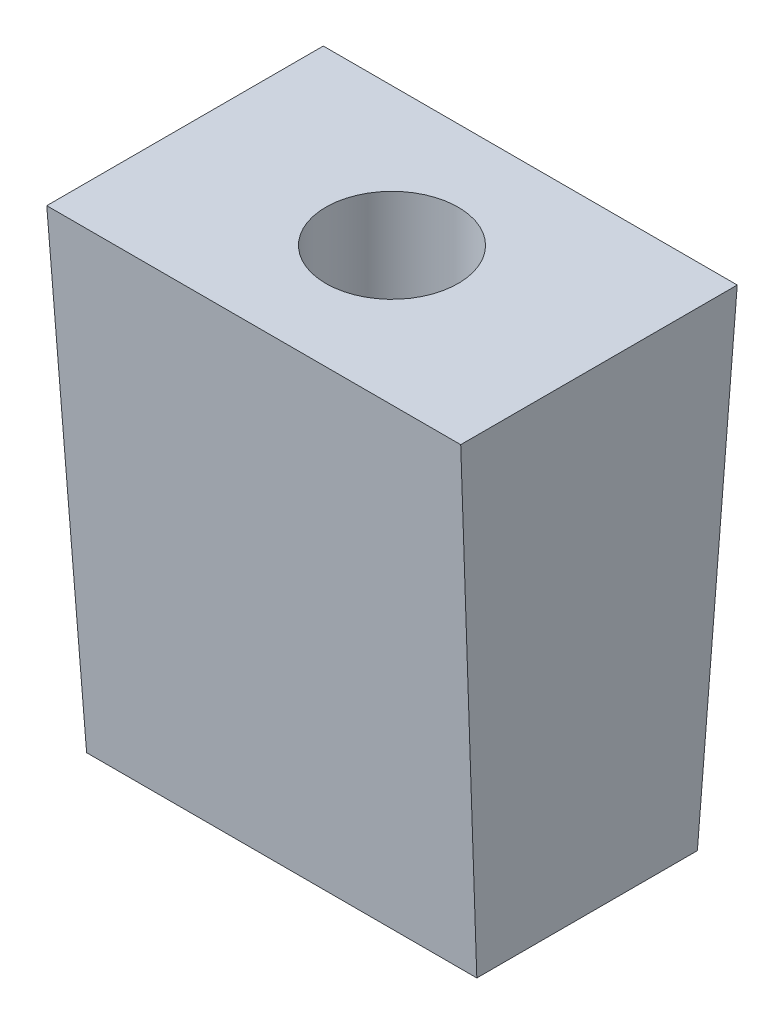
ISO-10303-21;
HEADER;
FILE_DESCRIPTION(('STEP AP214'),'2;1');
FILE_NAME('part.step','',(''),(''),'','','');
FILE_SCHEMA(('AUTOMOTIVE_DESIGN { 1 0 10303 214 1 1 1 1 }'));
ENDSEC;
DATA;
#1=APPLICATION_CONTEXT('core data for automotive mechanical design processes');
#2=APPLICATION_PROTOCOL_DEFINITION('international standard','automotive_design',2000,#1);
#3=PRODUCT_CONTEXT('',#1,'mechanical');
#4=PRODUCT('Part','Part','',(#3));
#5=PRODUCT_RELATED_PRODUCT_CATEGORY('part','',(#4));
#6=PRODUCT_DEFINITION_FORMATION('','',#4);
#7=PRODUCT_DEFINITION_CONTEXT('part definition',#1,'design');
#8=PRODUCT_DEFINITION('design','',#6,#7);
#9=PRODUCT_DEFINITION_SHAPE('','',#8);
#10=(LENGTH_UNIT() NAMED_UNIT(*) SI_UNIT(.MILLI.,.METRE.));
#11=(NAMED_UNIT(*) PLANE_ANGLE_UNIT() SI_UNIT($,.RADIAN.));
#12=(NAMED_UNIT(*) SI_UNIT($,.STERADIAN.) SOLID_ANGLE_UNIT());
#13=UNCERTAINTY_MEASURE_WITH_UNIT(LENGTH_MEASURE(1.E-05),#10,'distance_accuracy_value','');
#14=(GEOMETRIC_REPRESENTATION_CONTEXT(3) GLOBAL_UNCERTAINTY_ASSIGNED_CONTEXT((#13)) GLOBAL_UNIT_ASSIGNED_CONTEXT((#10,
#11,#12)) REPRESENTATION_CONTEXT('',''));
#15=CARTESIAN_POINT('',(0.,0.,0.));
#16=DIRECTION('',(0.,0.,1.));
#17=DIRECTION('',(1.,0.,0.));
#18=AXIS2_PLACEMENT_3D('',#15,#16,#17);
#19=CARTESIAN_POINT('',(0.,17.35,-4.075));
#20=DIRECTION('',(0.,-1.,0.));
#21=DIRECTION('',(0.,0.,-1.));
#22=AXIS2_PLACEMENT_3D('',#19,#20,#21);
#23=CYLINDRICAL_SURFACE('',#22,1.25);
#24=CARTESIAN_POINT('',(0.,9.2,-4.075));
#25=DIRECTION('',(0.,-1.,0.));
#26=DIRECTION('',(0.,0.,-1.));
#27=AXIS2_PLACEMENT_3D('',#24,#25,#26);
#28=CIRCLE('',#27,1.25);
#29=CARTESIAN_POINT('',(0.,9.2,-5.325));
#30=VERTEX_POINT('',#29);
#31=EDGE_CURVE('E116',#30,#30,#28,.T.);
#32=ORIENTED_EDGE('',*,*,#31,.T.);
#33=EDGE_LOOP('',(#32));
#34=FACE_BOUND('',#33,.T.);
#35=CARTESIAN_POINT('',(0.,11.3,-4.075));
#36=DIRECTION('',(0.,1.,0.));
#37=DIRECTION('',(0.,0.,1.));
#38=AXIS2_PLACEMENT_3D('',#35,#36,#37);
#39=CIRCLE('',#38,1.25);
#40=CARTESIAN_POINT('',(0.,11.3,-2.825));
#41=VERTEX_POINT('',#40);
#42=EDGE_CURVE('E37',#41,#41,#39,.F.);
#43=ORIENTED_EDGE('',*,*,#42,.F.);
#44=EDGE_LOOP('',(#43));
#45=FACE_BOUND('',#44,.T.);
#46=ADVANCED_FACE('F33',(#34,#45),#23,.F.);
#47=CARTESIAN_POINT('',(33.1477380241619,14.2,0.));
#48=DIRECTION('',(0.,0.0580007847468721,-0.998316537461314));
#49=DIRECTION('',(0.,0.998316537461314,0.0580007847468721));
#50=AXIS2_PLACEMENT_3D('',#47,#48,#49);
#51=PLANE('',#50);
#52=DIRECTION('',(-1.,0.,0.));
#53=VECTOR('',#52,1.);
#54=CARTESIAN_POINT('',(-6.1,14.2,0.));
#55=LINE('',#54,#53);
#56=CARTESIAN_POINT('',(6.1,14.2,0.));
#57=VERTEX_POINT('',#56);
#58=CARTESIAN_POINT('',(-6.1,14.2,0.));
#59=VERTEX_POINT('',#58);
#60=EDGE_CURVE('E82',#57,#59,#55,.T.);
#61=ORIENTED_EDGE('',*,*,#60,.T.);
#62=DIRECTION('',(0.0245989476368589,-0.998014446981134,-0.0579832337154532));
#63=VECTOR('',#62,1.);
#64=CARTESIAN_POINT('',(-5.73955215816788,-0.423883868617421,-0.849627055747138));
#65=LINE('',#64,#63);
#66=CARTESIAN_POINT('',(-5.75,0.,-0.825));
#67=VERTEX_POINT('',#66);
#68=EDGE_CURVE('E86',#59,#67,#65,.T.);
#69=ORIENTED_EDGE('',*,*,#68,.T.);
#70=DIRECTION('',(-1.,0.,0.));
#71=VECTOR('',#70,1.);
#72=CARTESIAN_POINT('',(33.1477380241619,0.,-0.825));
#73=LINE('',#72,#71);
#74=CARTESIAN_POINT('',(5.75,0.,-0.825));
#75=VERTEX_POINT('',#74);
#76=EDGE_CURVE('E106',#75,#67,#73,.T.);
#77=ORIENTED_EDGE('',*,*,#76,.F.);
#78=DIRECTION('',(0.0245989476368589,0.998014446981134,0.0579832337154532));
#79=VECTOR('',#78,1.);
#80=CARTESIAN_POINT('',(5.73955215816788,-0.423883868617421,-0.849627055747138));
#81=LINE('',#80,#79);
#82=EDGE_CURVE('E90',#75,#57,#81,.T.);
#83=ORIENTED_EDGE('',*,*,#82,.T.);
#84=EDGE_LOOP('',(#61,#69,#77,#83));
#85=FACE_BOUND('',#84,.T.);
#86=ADVANCED_FACE('F92',(#85),#51,.F.);
#87=CARTESIAN_POINT('',(-5.75,0.,-8.15));
#88=DIRECTION('',(0.,-1.,0.));
#89=DIRECTION('',(0.,0.,-1.));
#90=AXIS2_PLACEMENT_3D('',#87,#88,#89);
#91=PLANE('',#90);
#92=CARTESIAN_POINT('',(0.,0.,-4.075));
#93=DIRECTION('',(0.,-1.,0.));
#94=DIRECTION('',(0.,0.,-1.));
#95=AXIS2_PLACEMENT_3D('',#92,#93,#94);
#96=CIRCLE('',#95,2.45);
#97=CARTESIAN_POINT('',(0.,0.,-6.525));
#98=VERTEX_POINT('',#97);
#99=EDGE_CURVE('E113',#98,#98,#96,.T.);
#100=ORIENTED_EDGE('',*,*,#99,.F.);
#101=EDGE_LOOP('',(#100));
#102=FACE_BOUND('',#101,.T.);
#103=DIRECTION('',(0.,0.,1.));
#104=VECTOR('',#103,1.);
#105=CARTESIAN_POINT('',(5.75,0.,-8.15));
#106=LINE('',#105,#104);
#107=CARTESIAN_POINT('',(5.75,0.,-7.325));
#108=VERTEX_POINT('',#107);
#109=EDGE_CURVE('E50',#108,#75,#106,.T.);
#110=ORIENTED_EDGE('',*,*,#109,.T.);
#111=ORIENTED_EDGE('',*,*,#76,.T.);
#112=DIRECTION('',(0.,0.,1.));
#113=VECTOR('',#112,1.);
#114=CARTESIAN_POINT('',(-5.75,0.,-8.15));
#115=LINE('',#114,#113);
#116=CARTESIAN_POINT('',(-5.75,0.,-7.325));
#117=VERTEX_POINT('',#116);
#118=EDGE_CURVE('E58',#117,#67,#115,.T.);
#119=ORIENTED_EDGE('',*,*,#118,.F.);
#120=DIRECTION('',(-1.,0.,0.));
#121=VECTOR('',#120,1.);
#122=CARTESIAN_POINT('',(33.1477380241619,0.,-7.325));
#123=LINE('',#122,#121);
#124=EDGE_CURVE('E108',#108,#117,#123,.T.);
#125=ORIENTED_EDGE('',*,*,#124,.F.);
#126=EDGE_LOOP('',(#110,#111,#119,#125));
#127=FACE_BOUND('',#126,.T.);
#128=ADVANCED_FACE('F136',(#102,#127),#91,.T.);
#129=CARTESIAN_POINT('',(-5.75,0.,-8.15));
#130=DIRECTION('',(-0.999696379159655,-0.0246404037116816,0.));
#131=DIRECTION('',(0.0246404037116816,-0.999696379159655,0.));
#132=AXIS2_PLACEMENT_3D('',#129,#130,#131);
#133=PLANE('',#132);
#134=ORIENTED_EDGE('',*,*,#68,.F.);
#135=DIRECTION('',(0.,0.,1.));
#136=VECTOR('',#135,1.);
#137=CARTESIAN_POINT('',(-6.1,14.2,-8.15));
#138=LINE('',#137,#136);
#139=CARTESIAN_POINT('',(-6.1,14.2,-8.15));
#140=VERTEX_POINT('',#139);
#141=EDGE_CURVE('E11',#140,#59,#138,.T.);
#142=ORIENTED_EDGE('',*,*,#141,.F.);
#143=DIRECTION('',(-0.0245989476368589,0.998014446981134,-0.0579832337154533));
#144=VECTOR('',#143,1.);
#145=CARTESIAN_POINT('',(-5.75117671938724,0.0477411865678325,-7.32777369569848));
#146=LINE('',#145,#144);
#147=EDGE_CURVE('E93',#117,#140,#146,.T.);
#148=ORIENTED_EDGE('',*,*,#147,.F.);
#149=ORIENTED_EDGE('',*,*,#118,.T.);
#150=EDGE_LOOP('',(#134,#142,#148,#149));
#151=FACE_BOUND('',#150,.T.);
#152=ADVANCED_FACE('F35',(#151),#133,.T.);
#153=CARTESIAN_POINT('',(-6.1,14.2,-8.15));
#154=DIRECTION('',(0.,1.,0.));
#155=DIRECTION('',(0.,0.,1.));
#156=AXIS2_PLACEMENT_3D('',#153,#154,#155);
#157=PLANE('',#156);
#158=CARTESIAN_POINT('',(0.,14.2,-4.075));
#159=DIRECTION('',(0.,1.,0.));
#160=DIRECTION('',(0.,0.,1.));
#161=AXIS2_PLACEMENT_3D('',#158,#159,#160);
#162=CIRCLE('',#161,1.95);
#163=CARTESIAN_POINT('',(0.,14.2,-2.125));
#164=VERTEX_POINT('',#163);
#165=EDGE_CURVE('E122',#164,#164,#162,.T.);
#166=ORIENTED_EDGE('',*,*,#165,.F.);
#167=EDGE_LOOP('',(#166));
#168=FACE_BOUND('',#167,.T.);
#169=ORIENTED_EDGE('',*,*,#60,.F.);
#170=DIRECTION('',(0.,0.,1.));
#171=VECTOR('',#170,1.);
#172=CARTESIAN_POINT('',(6.1,14.2,-8.15));
#173=LINE('',#172,#171);
#174=CARTESIAN_POINT('',(6.1,14.2,-8.15));
#175=VERTEX_POINT('',#174);
#176=EDGE_CURVE('E42',#175,#57,#173,.T.);
#177=ORIENTED_EDGE('',*,*,#176,.F.);
#178=DIRECTION('',(-1.,0.,0.));
#179=VECTOR('',#178,1.);
#180=CARTESIAN_POINT('',(-6.1,14.2,-8.15));
#181=LINE('',#180,#179);
#182=EDGE_CURVE('E84',#175,#140,#181,.T.);
#183=ORIENTED_EDGE('',*,*,#182,.T.);
#184=ORIENTED_EDGE('',*,*,#141,.T.);
#185=EDGE_LOOP('',(#169,#177,#183,#184));
#186=FACE_BOUND('',#185,.T.);
#187=ADVANCED_FACE('F79',(#168,#186),#157,.T.);
#188=CARTESIAN_POINT('',(5.75,0.,-8.15));
#189=DIRECTION('',(0.999696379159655,-0.0246404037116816,0.));
#190=DIRECTION('',(0.0246404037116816,0.999696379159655,0.));
#191=AXIS2_PLACEMENT_3D('',#188,#189,#190);
#192=PLANE('',#191);
#193=ORIENTED_EDGE('',*,*,#82,.F.);
#194=ORIENTED_EDGE('',*,*,#109,.F.);
#195=DIRECTION('',(-0.0245989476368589,-0.998014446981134,0.0579832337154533));
#196=VECTOR('',#195,1.);
#197=CARTESIAN_POINT('',(5.75117671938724,0.0477411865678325,-7.32777369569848));
#198=LINE('',#197,#196);
#199=EDGE_CURVE('E89',#175,#108,#198,.T.);
#200=ORIENTED_EDGE('',*,*,#199,.F.);
#201=ORIENTED_EDGE('',*,*,#176,.T.);
#202=EDGE_LOOP('',(#193,#194,#200,#201));
#203=FACE_BOUND('',#202,.T.);
#204=ADVANCED_FACE('F102',(#203),#192,.T.);
#205=CARTESIAN_POINT('',(33.1477380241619,0.,-7.325));
#206=DIRECTION('',(0.,0.0580007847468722,0.998316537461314));
#207=DIRECTION('',(0.,-0.998316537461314,0.0580007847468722));
#208=AXIS2_PLACEMENT_3D('',#205,#206,#207);
#209=PLANE('',#208);
#210=ORIENTED_EDGE('',*,*,#124,.T.);
#211=ORIENTED_EDGE('',*,*,#147,.T.);
#212=ORIENTED_EDGE('',*,*,#182,.F.);
#213=ORIENTED_EDGE('',*,*,#199,.T.);
#214=EDGE_LOOP('',(#210,#211,#212,#213));
#215=FACE_BOUND('',#214,.T.);
#216=ADVANCED_FACE('F134',(#215),#209,.F.);
#217=CARTESIAN_POINT('',(0.,9.2,-4.075));
#218=DIRECTION('',(0.,-1.,0.));
#219=DIRECTION('',(0.,0.,-1.));
#220=AXIS2_PLACEMENT_3D('',#217,#218,#219);
#221=CYLINDRICAL_SURFACE('',#220,2.45);
#222=CARTESIAN_POINT('',(0.,9.2,-4.075));
#223=DIRECTION('',(0.,-1.,0.));
#224=DIRECTION('',(0.,0.,-1.));
#225=AXIS2_PLACEMENT_3D('',#222,#223,#224);
#226=CIRCLE('',#225,2.45);
#227=CARTESIAN_POINT('',(0.,9.2,-6.525));
#228=VERTEX_POINT('',#227);
#229=EDGE_CURVE('E110',#228,#228,#226,.T.);
#230=ORIENTED_EDGE('',*,*,#229,.F.);
#231=EDGE_LOOP('',(#230));
#232=FACE_BOUND('',#231,.T.);
#233=ORIENTED_EDGE('',*,*,#99,.T.);
#234=EDGE_LOOP('',(#233));
#235=FACE_BOUND('',#234,.T.);
#236=ADVANCED_FACE('F152',(#232,#235),#221,.F.);
#237=CARTESIAN_POINT('',(0.,9.2,-4.075));
#238=DIRECTION('',(0.,-1.,0.));
#239=DIRECTION('',(0.,0.,-1.));
#240=AXIS2_PLACEMENT_3D('',#237,#238,#239);
#241=PLANE('',#240);
#242=ORIENTED_EDGE('',*,*,#31,.F.);
#243=EDGE_LOOP('',(#242));
#244=FACE_BOUND('',#243,.T.);
#245=ORIENTED_EDGE('',*,*,#229,.T.);
#246=EDGE_LOOP('',(#245));
#247=FACE_BOUND('',#246,.T.);
#248=ADVANCED_FACE('F148',(#244,#247),#241,.T.);
#249=CARTESIAN_POINT('',(0.,11.3,-4.075));
#250=DIRECTION('',(0.,1.,0.));
#251=DIRECTION('',(0.,0.,1.));
#252=AXIS2_PLACEMENT_3D('',#249,#250,#251);
#253=PLANE('',#252);
#254=CARTESIAN_POINT('',(0.,11.3,-4.075));
#255=DIRECTION('',(0.,1.,0.));
#256=DIRECTION('',(0.,0.,1.));
#257=AXIS2_PLACEMENT_3D('',#254,#255,#256);
#258=CIRCLE('',#257,1.95);
#259=CARTESIAN_POINT('',(0.,11.3,-2.125));
#260=VERTEX_POINT('',#259);
#261=EDGE_CURVE('E119',#260,#260,#258,.T.);
#262=ORIENTED_EDGE('',*,*,#261,.T.);
#263=EDGE_LOOP('',(#262));
#264=FACE_BOUND('',#263,.T.);
#265=ORIENTED_EDGE('',*,*,#42,.T.);
#266=EDGE_LOOP('',(#265));
#267=FACE_BOUND('',#266,.T.);
#268=ADVANCED_FACE('F151',(#264,#267),#253,.T.);
#269=CARTESIAN_POINT('',(0.,11.3,-4.075));
#270=DIRECTION('',(0.,1.,0.));
#271=DIRECTION('',(0.,0.,1.));
#272=AXIS2_PLACEMENT_3D('',#269,#270,#271);
#273=CYLINDRICAL_SURFACE('',#272,1.95);
#274=ORIENTED_EDGE('',*,*,#261,.F.);
#275=EDGE_LOOP('',(#274));
#276=FACE_BOUND('',#275,.T.);
#277=ORIENTED_EDGE('',*,*,#165,.T.);
#278=EDGE_LOOP('',(#277));
#279=FACE_BOUND('',#278,.T.);
#280=ADVANCED_FACE('F126',(#276,#279),#273,.F.);
#281=CLOSED_SHELL('',(#46,#86,#128,#152,#187,#204,#216,#236,#248,#268,#280));
#282=MANIFOLD_SOLID_BREP('B2',#281);
#283=ADVANCED_BREP_SHAPE_REPRESENTATION('',(#18,#282),#14);
#284=SHAPE_DEFINITION_REPRESENTATION(#9,#283);
ENDSEC;
END-ISO-10303-21;
